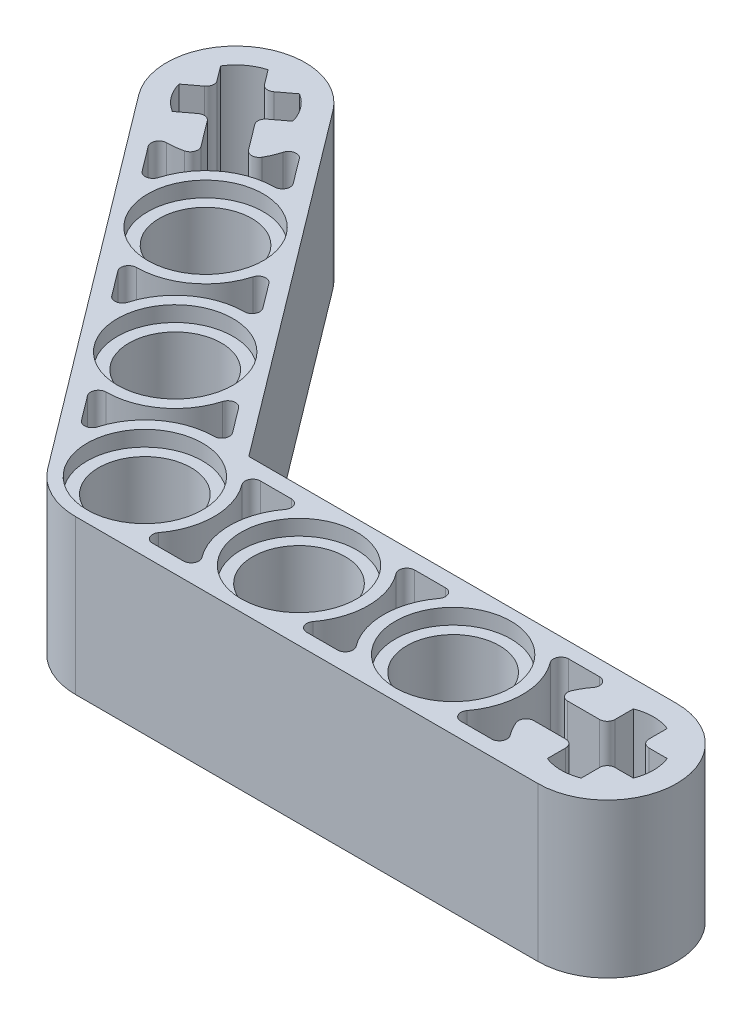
from build123d import *

# Parameters (mm, degrees)
BOSS_EXTRUDE1_DEPTH      = 4
BOSS_EXTRUDE1_DEPTH_BACK = 4
SKETCH1_R                = 2.4
SKETCH2_R                = 3
CUT_EXTRUDE1_DEPTH       = 0.8
CUT_EXTRUDE2_START       = -3.2
CUT_EXTRUDE2_DEPTH       = 3.2


with BuildPart() as part:
    # Sketch1 → Boss-Extrude1 (new, two sides: drawn at the far end of the back side and taken through both)
    with BuildSketch(Plane(origin=(0, 0, 0), x_dir=(1, 0, 0), z_dir=(0, 1, 0)).offset(-BOSS_EXTRUDE1_DEPTH_BACK)):
        with BuildLine():
            Line((24, 3.6), (1.794893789, 3.6))
            Line((1.794893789, 3.6), (-11.568472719, 21.333786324))
            ThreePointArc((-11.568472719, 21.333786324), (-16.610094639, 22.042340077), (-17.318648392, 17.000718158))
            Line((-17.318648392, 17.000718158), (-2.875087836, -2.166534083))
            ThreePointArc((-2.875087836, -2.166534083), (-1.606312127, -3.221763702), (0, -3.6))
            Line((0, -3.6), (24, -3.6))
            ThreePointArc((24, -3.6), (27.6, 0), (24, 3.6))
        make_face()
        with Locations(Location((0, 0, 0), (0, 0, 270))):
            Circle(SKETCH1_R, mode=Mode.SUBTRACT)
        with Locations(Location((8, 0, 0), (0, 0, 270))):
            Circle(SKETCH1_R, mode=Mode.SUBTRACT)
        with Locations(Location((16, 0, 0), (0, 0, 270))):
            Circle(SKETCH1_R, mode=Mode.SUBTRACT)
        with Locations(Location((-4.814520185, 6.38908408, 0), (0, 0, 270))):
            Circle(SKETCH1_R, mode=Mode.SUBTRACT)
        with Locations(Location((-9.62904037, 12.778168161, 0), (0, 0, 270))):
            Circle(SKETCH1_R, mode=Mode.SUBTRACT)
        with BuildLine():
            Line((21.767154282, 0.88), (22.72, 0.88))
            ThreePointArc((22.72, 0.88), (23.002842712, 0.997157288), (23.12, 1.28))
            Line((23.12, 1.28), (23.12, 2.232845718))
            ThreePointArc((23.12, 2.232845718), (24, 2.4), (24.88, 2.232845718))
            Line((24.88, 2.232845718), (24.88, 1.28))
            ThreePointArc((24.88, 1.28), (24.997157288, 0.997157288), (25.28, 0.88))
            Line((25.28, 0.88), (26.232845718, 0.88))
            ThreePointArc((26.232845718, 0.88), (26.4, 0), (26.232845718, -0.88))
            Line((26.232845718, -0.88), (25.28, -0.88))
            ThreePointArc((25.28, -0.88), (24.997157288, -0.997157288), (24.88, -1.28))
            Line((24.88, -1.28), (24.88, -2.232845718))
            ThreePointArc((24.88, -2.232845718), (24, -2.4), (23.12, -2.232845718))
            Line((23.12, -2.232845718), (23.12, -1.28))
            ThreePointArc((23.12, -1.28), (23.002842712, -0.997157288), (22.72, -0.88))
            Line((22.72, -0.88), (21.767154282, -0.88))
            Line((21.767154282, -0.88), (21.067151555, -0.88))
            ThreePointArc((21.067151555, -0.88), (20.732487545, -1.060910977), (20.7005455, -1.44))
            ThreePointArc((20.7005455, -1.44), (20.889370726, -1.812177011), (21.12, -2.16))
            ThreePointArc((21.12, -2.16), (21.157770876, -2.578885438), (20.8, -2.8))
            Line((20.8, -2.8), (19.2, -2.8))
            ThreePointArc((19.2, -2.8), (18.842229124, -2.578885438), (18.88, -2.16))
            ThreePointArc((18.88, -2.16), (19.6, 0), (18.88, 2.16))
            ThreePointArc((18.88, 2.16), (18.842229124, 2.578885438), (19.2, 2.8))
            Line((19.2, 2.8), (20.8, 2.8))
            ThreePointArc((20.8, 2.8), (21.157770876, 2.578885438), (21.12, 2.16))
            ThreePointArc((21.12, 2.16), (20.889370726, 1.812177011), (20.7005455, 1.44))
            ThreePointArc((20.7005455, 1.44), (20.732487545, 1.060910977), (21.067151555, 0.88))
            Line((21.067151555, 0.88), (21.767154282, 0.88))
        make_face(mode=Mode.SUBTRACT)
        with BuildLine():
            Line((-13.802599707, 16.854425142), (-14.376036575, 17.615401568))
            ThreePointArc((-14.376036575, 17.615401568), (-14.639821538, 17.770782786), (-14.936216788, 17.694129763))
            Line((-14.936216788, 17.694129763), (-15.697193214, 17.120692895))
            ThreePointArc((-15.697193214, 17.120692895), (-16.36028578, 17.722896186), (-16.756387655, 18.526291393))
            Line((-16.756387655, 18.526291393), (-15.995411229, 19.09972826))
            ThreePointArc((-15.995411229, 19.09972826), (-15.840030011, 19.363513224), (-15.916683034, 19.659908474))
            Line((-15.916683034, 19.659908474), (-16.490119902, 20.4208849))
            ThreePointArc((-16.490119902, 20.4208849), (-15.887916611, 21.083977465), (-15.084521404, 21.48007934))
            Line((-15.084521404, 21.48007934), (-14.511084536, 20.719102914))
            ThreePointArc((-14.511084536, 20.719102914), (-14.247299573, 20.563721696), (-13.950904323, 20.64037472))
            Line((-13.950904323, 20.64037472), (-13.189927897, 21.213811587))
            ThreePointArc((-13.189927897, 21.213811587), (-12.526835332, 20.611608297), (-12.130733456, 19.80821309))
            Line((-12.130733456, 19.80821309), (-12.891709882, 19.234776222))
            ThreePointArc((-12.891709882, 19.234776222), (-13.047091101, 18.970991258), (-12.970438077, 18.674596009))
            Line((-12.970438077, 18.674596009), (-12.397001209, 17.913619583))
            Line((-12.397001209, 17.913619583), (-11.975729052, 17.354572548))
            ThreePointArc((-11.975729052, 17.354572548), (-11.629841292, 17.196172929), (-11.307864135, 17.398804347))
            ThreePointArc((-11.307864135, 17.398804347), (-11.124268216, 17.773588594), (-10.985280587, 18.167102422))
            ThreePointArc((-10.985280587, 18.167102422), (-10.673474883, 18.449359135), (-10.281573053, 18.296700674))
            Line((-10.281573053, 18.296700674), (-9.318669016, 17.018883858))
            ThreePointArc((-9.318669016, 17.018883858), (-9.279947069, 16.600085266), (-9.637214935, 16.37815888))
            ThreePointArc((-9.637214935, 16.37815888), (-11.795574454, 15.653255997), (-13.087320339, 13.77831798))
            ThreePointArc((-13.087320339, 13.77831798), (-13.399126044, 13.496061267), (-13.791027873, 13.648719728))
            Line((-13.791027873, 13.648719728), (-14.75393191, 14.926536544))
            ThreePointArc((-14.75393191, 14.926536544), (-14.792653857, 15.345335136), (-14.435385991, 15.567261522))
            ThreePointArc((-14.435385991, 15.567261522), (-14.018806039, 15.592397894), (-13.607934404, 15.66557708))
            ThreePointArc((-13.607934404, 15.66557708), (-13.324403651, 15.919228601), (-13.38132755, 16.295378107))
            Line((-13.38132755, 16.295378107), (-13.802599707, 16.854425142))
        make_face(mode=Mode.SUBTRACT)
    extrude(amount=BOSS_EXTRUDE1_DEPTH + BOSS_EXTRUDE1_DEPTH_BACK)

    # Sketch2 → Cut-Extrude1 (cut)
    with BuildSketch(Plane(origin=(0, 4, 0), x_dir=(1, 0, 0), z_dir=(0, 1, 0))):
        with Locations(Location((16, 0, 0), (0, 0, 270))):
            Circle(SKETCH2_R)
        with Locations(Location((8, 0, 0), (0, 0, 270))):
            Circle(SKETCH2_R)
        with Locations(Location((0, 0, 0), (0, 0, 270))):
            Circle(SKETCH2_R)
        with Locations(Location((-4.814520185, 6.38908408, 0), (0, 0, 270))):
            Circle(SKETCH2_R)
        with Locations(Location((-9.62904037, 12.778168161, 0), (0, 0, 270))):
            Circle(SKETCH2_R)
    cut_extrude1 = extrude(amount=-CUT_EXTRUDE1_DEPTH, mode=Mode.SUBTRACT)

    # Mirror1: Cut-Extrude1 across plane
    add(cut_extrude1.mirror(Plane.ZX), mode=Mode.SUBTRACT)

    # Sketch3 → Cut-Extrude2 (cut)
    with BuildSketch(Plane(origin=(0, 4, 0), x_dir=(1, 0, 0), z_dir=(0, 1, 0)).offset(CUT_EXTRUDE2_START)):
        with BuildLine():
            Line((11.2, 2.8), (12.8, 2.8))
            ThreePointArc((12.8, 2.8), (13.157770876, 2.578885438), (13.12, 2.16))
            ThreePointArc((13.12, 2.16), (12.4, 0), (13.12, -2.16))
            ThreePointArc((13.12, -2.16), (13.157770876, -2.578885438), (12.8, -2.8))
            Line((12.8, -2.8), (11.2, -2.8))
            ThreePointArc((11.2, -2.8), (10.842229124, -2.578885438), (10.88, -2.16))
            ThreePointArc((10.88, -2.16), (11.6, 0), (10.88, 2.16))
            ThreePointArc((10.88, 2.16), (10.842229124, 2.578885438), (11.2, 2.8))
        make_face()
        with BuildLine():
            Line((3.2, 2.8), (4.8, 2.8))
            ThreePointArc((4.8, 2.8), (5.157770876, 2.578885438), (5.12, 2.16))
            ThreePointArc((5.12, 2.16), (4.4, 0), (5.12, -2.16))
            ThreePointArc((5.12, -2.16), (5.157770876, -2.578885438), (4.8, -2.8))
            Line((4.8, -2.8), (3.2, -2.8))
            ThreePointArc((3.2, -2.8), (2.842229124, -2.578885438), (2.88, -2.16))
            ThreePointArc((2.88, -2.16), (3.6, 0), (2.88, 2.16))
            ThreePointArc((2.88, 2.16), (2.842229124, 2.578885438), (3.2, 2.8))
        make_face()
        with BuildLine():
            Line((-4.161987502, 0.870551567), (-5.124891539, 2.148368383))
            ThreePointArc((-5.124891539, 2.148368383), (-5.163613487, 2.567166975), (-4.80634562, 2.789093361))
            ThreePointArc((-4.80634562, 2.789093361), (-2.647986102, 3.513996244), (-1.356240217, 5.388934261))
            ThreePointArc((-1.356240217, 5.388934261), (-1.044434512, 5.671190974), (-0.652532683, 5.518532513))
            Line((-0.652532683, 5.518532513), (0.310371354, 4.240715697))
            ThreePointArc((0.310371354, 4.240715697), (0.349093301, 3.821917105), (-0.008174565, 3.599990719))
            ThreePointArc((-0.008174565, 3.599990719), (-2.166534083, 2.875087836), (-3.458279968, 1.000149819))
            ThreePointArc((-3.458279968, 1.000149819), (-3.770085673, 0.717893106), (-4.161987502, 0.870551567))
        make_face()
        with BuildLine():
            Line((-8.976507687, 7.259635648), (-9.939411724, 8.537452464))
            ThreePointArc((-9.939411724, 8.537452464), (-9.978133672, 8.956251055), (-9.620865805, 9.178177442))
            ThreePointArc((-9.620865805, 9.178177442), (-7.462506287, 9.903080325), (-6.170760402, 11.778018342))
            ThreePointArc((-6.170760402, 11.778018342), (-5.858954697, 12.060275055), (-5.467052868, 11.907616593))
            Line((-5.467052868, 11.907616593), (-4.504148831, 10.629799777))
            ThreePointArc((-4.504148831, 10.629799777), (-4.465426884, 10.211001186), (-4.82269475, 9.989074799))
            ThreePointArc((-4.82269475, 9.989074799), (-6.981054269, 9.264171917), (-8.272800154, 7.389233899))
            ThreePointArc((-8.272800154, 7.389233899), (-8.584605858, 7.106977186), (-8.976507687, 7.259635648))
        make_face()
    cut_extrude2 = extrude(amount=CUT_EXTRUDE2_DEPTH, mode=Mode.SUBTRACT)

    # Mirror2: Cut-Extrude2 across plane
    add(cut_extrude2.mirror(Plane.ZX), mode=Mode.SUBTRACT)


solid = part.part
